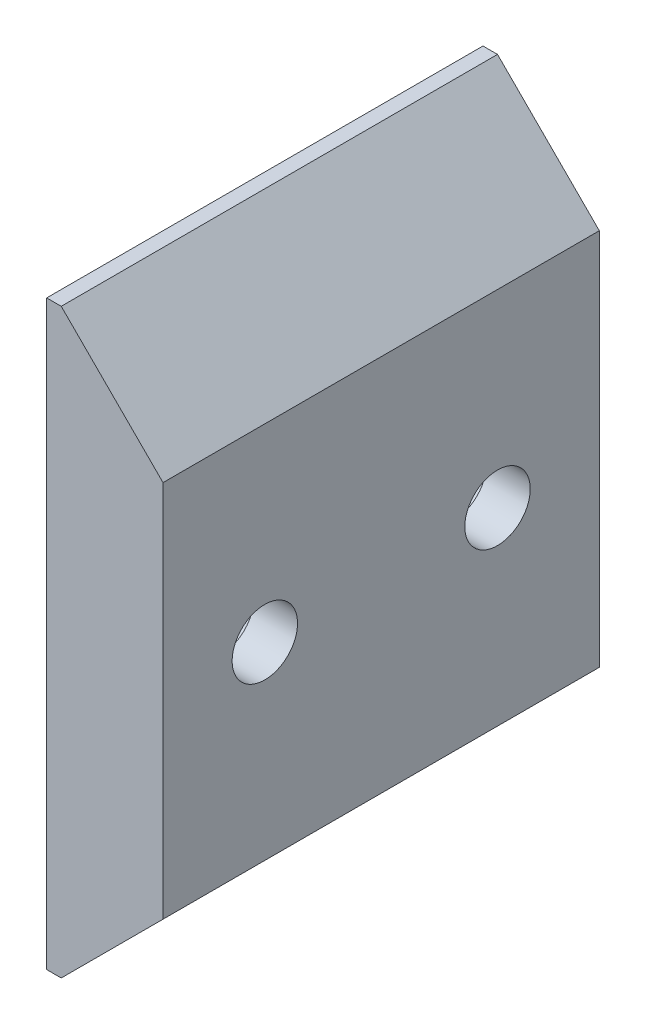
from build123d import *

# Parameters (mm, degrees)
EXTRUSION1_DEPTH                                = 15
CHAMBRAGE_POUR_VIS_T_TE_CYLINDRIQUE_D           = 4.5
CHAMBRAGE_POUR_VIS_T_TE_CYLINDRIQUE_CBORE_D     = 8
CHAMBRAGE_POUR_VIS_T_TE_CYLINDRIQUE_CBORE_DEPTH = 5


with BuildPart() as part:
    # Esquisse1 → Extrusion1 (new, symmetric)
    with BuildSketch(Plane.XY):
        Polygon((0, -20), (0, 20), (1, 20), (8, 13), (8, -13), (1, -20), align=None)
    extrude(amount=EXTRUSION1_DEPTH, both=True)

    # Chambrage pour vis _ t_te cylindrique (through all)
    with Locations(Plane.ZY):
        with Locations((8, 0), (-8, 0)):
            CounterBoreHole(CHAMBRAGE_POUR_VIS_T_TE_CYLINDRIQUE_D / 2, CHAMBRAGE_POUR_VIS_T_TE_CYLINDRIQUE_CBORE_D / 2, CHAMBRAGE_POUR_VIS_T_TE_CYLINDRIQUE_CBORE_DEPTH)


solid = part.part
